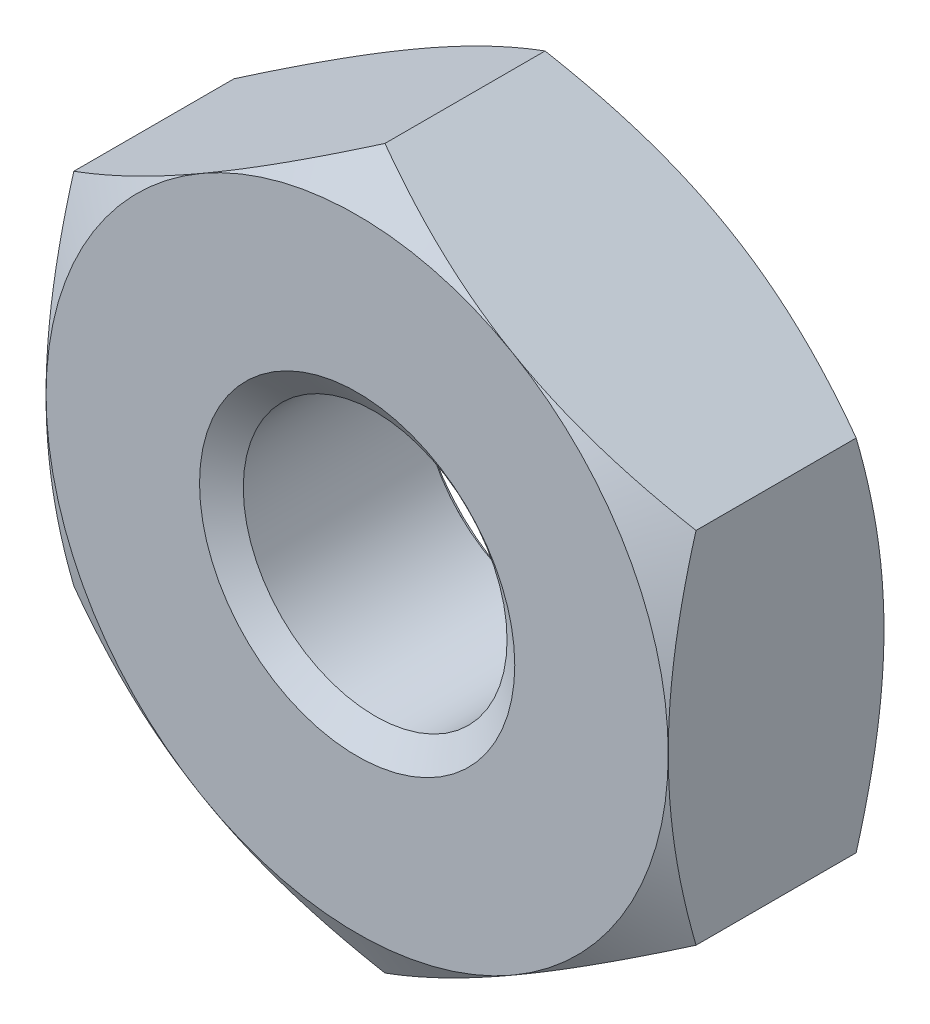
ISO-10303-21;
HEADER;
FILE_DESCRIPTION(('STEP AP214'),'2;1');
FILE_NAME('part.step','',(''),(''),'','','');
FILE_SCHEMA(('AUTOMOTIVE_DESIGN { 1 0 10303 214 1 1 1 1 }'));
ENDSEC;
DATA;
#1=APPLICATION_CONTEXT('core data for automotive mechanical design processes');
#2=APPLICATION_PROTOCOL_DEFINITION('international standard','automotive_design',2000,#1);
#3=PRODUCT_CONTEXT('',#1,'mechanical');
#4=PRODUCT('Part','Part','',(#3));
#5=PRODUCT_RELATED_PRODUCT_CATEGORY('part','',(#4));
#6=PRODUCT_DEFINITION_FORMATION('','',#4);
#7=PRODUCT_DEFINITION_CONTEXT('part definition',#1,'design');
#8=PRODUCT_DEFINITION('design','',#6,#7);
#9=PRODUCT_DEFINITION_SHAPE('','',#8);
#10=(LENGTH_UNIT() NAMED_UNIT(*) SI_UNIT(.MILLI.,.METRE.));
#11=(NAMED_UNIT(*) PLANE_ANGLE_UNIT() SI_UNIT($,.RADIAN.));
#12=(NAMED_UNIT(*) SI_UNIT($,.STERADIAN.) SOLID_ANGLE_UNIT());
#13=UNCERTAINTY_MEASURE_WITH_UNIT(LENGTH_MEASURE(1.E-05),#10,'distance_accuracy_value','');
#14=(GEOMETRIC_REPRESENTATION_CONTEXT(3) GLOBAL_UNCERTAINTY_ASSIGNED_CONTEXT((#13)) GLOBAL_UNIT_ASSIGNED_CONTEXT((#10,
#11,#12)) REPRESENTATION_CONTEXT('',''));
#15=CARTESIAN_POINT('',(0.,0.,0.));
#16=DIRECTION('',(0.,0.,1.));
#17=DIRECTION('',(1.,0.,0.));
#18=AXIS2_PLACEMENT_3D('',#15,#16,#17);
#19=CARTESIAN_POINT('',(0.,0.,-3.302));
#20=DIRECTION('',(0.,0.,1.));
#21=DIRECTION('',(1.,0.,0.));
#22=AXIS2_PLACEMENT_3D('',#19,#20,#21);
#23=CYLINDRICAL_SURFACE('',#22,2.0193);
#24=CARTESIAN_POINT('',(0.,0.,-0.275671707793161));
#25=DIRECTION('',(0.,0.,1.));
#26=DIRECTION('',(1.,0.,0.));
#27=AXIS2_PLACEMENT_3D('',#24,#25,#26);
#28=CIRCLE('',#27,2.0193);
#29=CARTESIAN_POINT('',(2.0193,0.,-0.275671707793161));
#30=VERTEX_POINT('',#29);
#31=EDGE_CURVE('E172',#30,#30,#28,.F.);
#32=CARTESIAN_POINT('',(0.,0.,-3.00092829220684));
#33=DIRECTION('',(0.,0.,-1.));
#34=DIRECTION('',(-1.,0.,0.));
#35=AXIS2_PLACEMENT_3D('',#32,#33,#34);
#36=CIRCLE('',#35,2.0193);
#37=CARTESIAN_POINT('',(2.0193,0.,-3.00092829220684));
#38=VERTEX_POINT('',#37);
#39=EDGE_CURVE('E37',#38,#38,#36,.F.);
#40=CARTESIAN_POINT('',(2.0193,0.,-0.275671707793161));
#41=CARTESIAN_POINT('',(2.0193,0.,-0.304059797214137));
#42=CARTESIAN_POINT('',(2.0193,0.,-0.332447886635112));
#43=CARTESIAN_POINT('',(2.0193,0.,-0.389224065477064));
#44=CARTESIAN_POINT('',(2.0193,0.,-0.41761215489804));
#45=CARTESIAN_POINT('',(2.0193,0.,-0.474388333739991));
#46=CARTESIAN_POINT('',(2.0193,0.,-0.502776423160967));
#47=CARTESIAN_POINT('',(2.0193,0.,-0.559552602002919));
#48=CARTESIAN_POINT('',(2.0193,0.,-0.587940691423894));
#49=CARTESIAN_POINT('',(2.0193,0.,-0.644716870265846));
#50=CARTESIAN_POINT('',(2.0193,0.,-0.673104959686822));
#51=CARTESIAN_POINT('',(2.0193,0.,-0.729881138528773));
#52=CARTESIAN_POINT('',(2.0193,0.,-0.758269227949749));
#53=CARTESIAN_POINT('',(2.0193,0.,-0.815045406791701));
#54=CARTESIAN_POINT('',(2.0193,0.,-0.843433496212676));
#55=CARTESIAN_POINT('',(2.0193,0.,-0.900209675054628));
#56=CARTESIAN_POINT('',(2.0193,0.,-0.928597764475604));
#57=CARTESIAN_POINT('',(2.0193,0.,-0.985373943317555));
#58=CARTESIAN_POINT('',(2.0193,0.,-1.01376203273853));
#59=CARTESIAN_POINT('',(2.0193,0.,-1.07053821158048));
#60=CARTESIAN_POINT('',(2.0193,0.,-1.09892630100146));
#61=CARTESIAN_POINT('',(2.0193,0.,-1.15570247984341));
#62=CARTESIAN_POINT('',(2.0193,0.,-1.18409056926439));
#63=CARTESIAN_POINT('',(2.0193,0.,-1.24086674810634));
#64=CARTESIAN_POINT('',(2.0193,0.,-1.26925483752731));
#65=CARTESIAN_POINT('',(2.0193,0.,-1.32603101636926));
#66=CARTESIAN_POINT('',(2.0193,0.,-1.35441910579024));
#67=CARTESIAN_POINT('',(2.0193,0.,-1.41119528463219));
#68=CARTESIAN_POINT('',(2.0193,0.,-1.43958337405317));
#69=CARTESIAN_POINT('',(2.0193,0.,-1.49635955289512));
#70=CARTESIAN_POINT('',(2.0193,0.,-1.5247476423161));
#71=CARTESIAN_POINT('',(2.0193,0.,-1.58152382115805));
#72=CARTESIAN_POINT('',(2.0193,0.,-1.60991191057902));
#73=CARTESIAN_POINT('',(2.0193,0.,-1.66668808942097));
#74=CARTESIAN_POINT('',(2.0193,0.,-1.69507617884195));
#75=CARTESIAN_POINT('',(2.0193,0.,-1.7518523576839));
#76=CARTESIAN_POINT('',(2.0193,0.,-1.78024044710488));
#77=CARTESIAN_POINT('',(2.0193,0.,-1.83701662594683));
#78=CARTESIAN_POINT('',(2.0193,0.,-1.8654047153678));
#79=CARTESIAN_POINT('',(2.0193,0.,-1.92218089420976));
#80=CARTESIAN_POINT('',(2.0193,0.,-1.95056898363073));
#81=CARTESIAN_POINT('',(2.0193,0.,-2.00734516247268));
#82=CARTESIAN_POINT('',(2.0193,0.,-2.03573325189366));
#83=CARTESIAN_POINT('',(2.0193,0.,-2.09250943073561));
#84=CARTESIAN_POINT('',(2.0193,0.,-2.12089752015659));
#85=CARTESIAN_POINT('',(2.0193,0.,-2.17767369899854));
#86=CARTESIAN_POINT('',(2.0193,0.,-2.20606178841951));
#87=CARTESIAN_POINT('',(2.0193,0.,-2.26283796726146));
#88=CARTESIAN_POINT('',(2.0193,0.,-2.29122605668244));
#89=CARTESIAN_POINT('',(2.0193,0.,-2.34800223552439));
#90=CARTESIAN_POINT('',(2.0193,0.,-2.37639032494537));
#91=CARTESIAN_POINT('',(2.0193,0.,-2.43316650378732));
#92=CARTESIAN_POINT('',(2.0193,0.,-2.4615545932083));
#93=CARTESIAN_POINT('',(2.0193,0.,-2.51833077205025));
#94=CARTESIAN_POINT('',(2.0193,0.,-2.54671886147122));
#95=CARTESIAN_POINT('',(2.0193,0.,-2.60349504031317));
#96=CARTESIAN_POINT('',(2.0193,0.,-2.63188312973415));
#97=CARTESIAN_POINT('',(2.0193,0.,-2.6886593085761));
#98=CARTESIAN_POINT('',(2.0193,0.,-2.71704739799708));
#99=CARTESIAN_POINT('',(2.0193,0.,-2.77382357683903));
#100=CARTESIAN_POINT('',(2.0193,0.,-2.80221166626));
#101=CARTESIAN_POINT('',(2.0193,0.,-2.85898784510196));
#102=CARTESIAN_POINT('',(2.0193,0.,-2.88737593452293));
#103=CARTESIAN_POINT('',(2.0193,0.,-2.94415211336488));
#104=CARTESIAN_POINT('',(2.0193,0.,-2.97254020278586));
#105=CARTESIAN_POINT('',(2.0193,0.,-3.00092829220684));
#106=B_SPLINE_CURVE_WITH_KNOTS('',3,(#40,#41,#42,#43,#44,#45,#46,#47,#48,#49,#50,#51,#52,#53,
#54,#55,#56,#57,#58,#59,#60,#61,#62,#63,#64,#65,#66,#67,#68,#69,#70,#71,#72,#73,#74,#75,#76,#77,
#78,#79,#80,#81,#82,#83,#84,#85,#86,#87,#88,#89,#90,#91,#92,#93,#94,#95,#96,#97,#98,#99,#100,
#101,#102,#103,#104,#105),.UNSPECIFIED.,.F.,.F.,(4,2,2,2,2,2,2,2,2,2,2,2,2,2,2,2,2,2,2,2,2,2,2,
2,2,2,2,2,2,2,2,2,4),(0.,0.0851642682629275,0.170328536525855,0.255492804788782,
0.34065707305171,0.425821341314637,0.510985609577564,0.596149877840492,0.681314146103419,
0.766478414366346,0.851642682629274,0.936806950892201,1.02197121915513,1.10713548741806,
1.19229975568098,1.27746402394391,1.36262829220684,1.44779256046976,1.53295682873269,
1.61812109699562,1.70328536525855,1.78844963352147,1.8736139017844,1.95877817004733,
2.04394243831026,2.12910670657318,2.21427097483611,2.29943524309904,2.38459951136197,
2.46976377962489,2.55492804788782,2.64009231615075,2.72525658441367),.UNSPECIFIED.);
#107=EDGE_CURVE('BSEAM32',#30,#38,#106,.T.);
#108=ORIENTED_EDGE('',*,*,#31,.F.);
#109=ORIENTED_EDGE('',*,*,#39,.F.);
#110=ORIENTED_EDGE('',*,*,#107,.T.);
#111=ORIENTED_EDGE('',*,*,#107,.F.);
#112=EDGE_LOOP('',(#108,#110,#109,#111));
#113=FACE_BOUND('',#112,.T.);
#114=ADVANCED_FACE('F32',(#113),#23,.F.);
#115=CARTESIAN_POINT('',(0.,5.49926131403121,-3.302));
#116=DIRECTION('',(0.,0.,-1.));
#117=DIRECTION('',(-1.,0.,0.));
#118=AXIS2_PLACEMENT_3D('',#115,#116,#117);
#119=PLANE('',#118);
#120=CARTESIAN_POINT('',(0.,0.,-3.302));
#121=DIRECTION('',(0.,0.,-1.));
#122=DIRECTION('',(-1.,0.,0.));
#123=AXIS2_PLACEMENT_3D('',#120,#121,#122);
#124=CIRCLE('',#123,4.7625);
#125=CARTESIAN_POINT('',(-4.7625,0.,-3.302));
#126=VERTEX_POINT('',#125);
#127=CARTESIAN_POINT('',(-2.38125,-4.12444598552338,-3.302));
#128=VERTEX_POINT('',#127);
#129=EDGE_CURVE('E168',#126,#128,#124,.F.);
#130=ORIENTED_EDGE('',*,*,#129,.F.);
#131=CARTESIAN_POINT('',(-2.38125000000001,4.1244459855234,-3.302));
#132=VERTEX_POINT('',#131);
#133=EDGE_CURVE('E150',#132,#126,#124,.F.);
#134=ORIENTED_EDGE('',*,*,#133,.F.);
#135=CARTESIAN_POINT('',(2.38125,4.12444598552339,-3.302));
#136=VERTEX_POINT('',#135);
#137=EDGE_CURVE('E167',#136,#132,#124,.F.);
#138=ORIENTED_EDGE('',*,*,#137,.F.);
#139=CARTESIAN_POINT('',(0.,0.,-3.302));
#140=DIRECTION('',(0.,0.,1.));
#141=DIRECTION('',(1.,0.,0.));
#142=AXIS2_PLACEMENT_3D('',#139,#140,#141);
#143=CIRCLE('',#142,4.7625);
#144=CARTESIAN_POINT('',(4.7625,0.,-3.302));
#145=VERTEX_POINT('',#144);
#146=EDGE_CURVE('E242',#145,#136,#143,.T.);
#147=ORIENTED_EDGE('',*,*,#146,.F.);
#148=CARTESIAN_POINT('',(2.38125000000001,-4.12444598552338,-3.302));
#149=VERTEX_POINT('',#148);
#150=EDGE_CURVE('E374',#149,#145,#124,.F.);
#151=ORIENTED_EDGE('',*,*,#150,.F.);
#152=EDGE_CURVE('E395',#128,#149,#124,.F.);
#153=ORIENTED_EDGE('',*,*,#152,.F.);
#154=EDGE_LOOP('',(#130,#134,#138,#147,#151,#153));
#155=FACE_BOUND('',#154,.T.);
#156=CARTESIAN_POINT('',(0.,0.,-3.302));
#157=DIRECTION('',(0.,0.,-1.));
#158=DIRECTION('',(-1.,0.,0.));
#159=AXIS2_PLACEMENT_3D('',#156,#157,#158);
#160=CIRCLE('',#159,2.413);
#161=CARTESIAN_POINT('',(2.413,0.,-3.302));
#162=VERTEX_POINT('',#161);
#163=EDGE_CURVE('E175',#162,#162,#160,.F.);
#164=ORIENTED_EDGE('',*,*,#163,.T.);
#165=EDGE_LOOP('',(#164));
#166=FACE_BOUND('',#165,.T.);
#167=ADVANCED_FACE('F247',(#155,#166),#119,.T.);
#168=CARTESIAN_POINT('',(0.,5.49926131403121,0.));
#169=DIRECTION('',(0.,0.,-1.));
#170=DIRECTION('',(-1.,0.,0.));
#171=AXIS2_PLACEMENT_3D('',#168,#169,#170);
#172=PLANE('',#171);
#173=CARTESIAN_POINT('',(0.,0.,0.));
#174=DIRECTION('',(0.,0.,-1.));
#175=DIRECTION('',(-1.,0.,0.));
#176=AXIS2_PLACEMENT_3D('',#173,#174,#175);
#177=CIRCLE('',#176,4.7625);
#178=CARTESIAN_POINT('',(-4.7625,0.,0.));
#179=VERTEX_POINT('',#178);
#180=CARTESIAN_POINT('',(-2.38125000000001,4.1244459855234,0.));
#181=VERTEX_POINT('',#180);
#182=EDGE_CURVE('E11',#179,#181,#177,.T.);
#183=ORIENTED_EDGE('',*,*,#182,.F.);
#184=CARTESIAN_POINT('',(-2.38125,-4.12444598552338,0.));
#185=VERTEX_POINT('',#184);
#186=EDGE_CURVE('E44',#185,#179,#177,.T.);
#187=ORIENTED_EDGE('',*,*,#186,.F.);
#188=CARTESIAN_POINT('',(2.38125000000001,-4.12444598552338,0.));
#189=VERTEX_POINT('',#188);
#190=EDGE_CURVE('E171',#189,#185,#177,.T.);
#191=ORIENTED_EDGE('',*,*,#190,.F.);
#192=CARTESIAN_POINT('',(4.7625,0.,0.));
#193=VERTEX_POINT('',#192);
#194=EDGE_CURVE('E340',#193,#189,#177,.T.);
#195=ORIENTED_EDGE('',*,*,#194,.F.);
#196=CARTESIAN_POINT('',(0.,0.,0.));
#197=DIRECTION('',(0.,0.,1.));
#198=DIRECTION('',(1.,0.,0.));
#199=AXIS2_PLACEMENT_3D('',#196,#197,#198);
#200=CIRCLE('',#199,4.7625);
#201=CARTESIAN_POINT('',(2.38125,4.12444598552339,0.));
#202=VERTEX_POINT('',#201);
#203=EDGE_CURVE('E126',#193,#202,#200,.T.);
#204=ORIENTED_EDGE('',*,*,#203,.T.);
#205=EDGE_CURVE('E42',#181,#202,#177,.T.);
#206=ORIENTED_EDGE('',*,*,#205,.F.);
#207=EDGE_LOOP('',(#183,#187,#191,#195,#204,#206));
#208=FACE_BOUND('',#207,.T.);
#209=CARTESIAN_POINT('',(0.,0.,0.));
#210=DIRECTION('',(0.,0.,1.));
#211=DIRECTION('',(1.,0.,0.));
#212=AXIS2_PLACEMENT_3D('',#209,#210,#211);
#213=CIRCLE('',#212,2.413);
#214=CARTESIAN_POINT('',(2.413,0.,0.));
#215=VERTEX_POINT('',#214);
#216=EDGE_CURVE('E174',#215,#215,#213,.T.);
#217=ORIENTED_EDGE('',*,*,#216,.F.);
#218=EDGE_LOOP('',(#217));
#219=FACE_BOUND('',#218,.T.);
#220=ADVANCED_FACE('F299',(#208,#219),#172,.F.);
#221=CARTESIAN_POINT('',(0.,5.49926131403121,-3.302));
#222=DIRECTION('',(-0.500000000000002,0.866025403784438,0.));
#223=DIRECTION('',(-0.866025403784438,-0.500000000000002,0.));
#224=AXIS2_PLACEMENT_3D('',#221,#222,#223);
#225=PLANE('',#224);
#226=DIRECTION('',(0.,0.,1.));
#227=VECTOR('',#226,1.);
#228=CARTESIAN_POINT('',(-4.7625,2.7496306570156,-3.302));
#229=LINE('',#228,#227);
#230=CARTESIAN_POINT('',(-4.7625,2.74963065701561,-2.87663065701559));
#231=VERTEX_POINT('',#230);
#232=CARTESIAN_POINT('',(-4.7625,2.7496306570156,-0.425369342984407));
#233=VERTEX_POINT('',#232);
#234=EDGE_CURVE('E162',#231,#233,#229,.T.);
#235=ORIENTED_EDGE('',*,*,#234,.T.);
#236=CARTESIAN_POINT('',(-4.7627,2.74951518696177,-0.425436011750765));
#237=CARTESIAN_POINT('',(-4.55340263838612,2.87035307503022,-0.355653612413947));
#238=CARTESIAN_POINT('',(-4.34231515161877,2.99222449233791,-0.292183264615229));
#239=CARTESIAN_POINT('',(-3.91648500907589,3.23807763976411,-0.181395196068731));
#240=CARTESIAN_POINT('',(-3.701734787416,3.36206373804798,-0.134116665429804));
#241=CARTESIAN_POINT('',(-3.27486304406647,3.60851825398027,-0.060533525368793));
#242=CARTESIAN_POINT('',(-3.06280800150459,3.73094828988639,-0.0337387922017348));
#243=CARTESIAN_POINT('',(-2.74397949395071,3.91502401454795,-0.00971112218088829));
#244=CARTESIAN_POINT('',(-2.63763059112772,3.97642458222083,-0.00439464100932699));
#245=CARTESIAN_POINT('',(-2.42483449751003,4.0992824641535,0.000759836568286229));
#246=CARTESIAN_POINT('',(-2.31838730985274,4.1607397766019,0.000598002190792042));
#247=CARTESIAN_POINT('',(-2.02675051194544,4.32911636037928,-0.00738494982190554));
#248=CARTESIAN_POINT('',(-1.84165753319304,4.4359798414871,-0.0207924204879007));
#249=CARTESIAN_POINT('',(-1.47270002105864,4.64899756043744,-0.0633078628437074));
#250=CARTESIAN_POINT('',(-1.28883678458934,4.75515104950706,-0.0924303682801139));
#251=CARTESIAN_POINT('',(-0.919135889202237,4.96859796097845,-0.165229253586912));
#252=CARTESIAN_POINT('',(-0.733344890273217,5.07586444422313,-0.209214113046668));
#253=CARTESIAN_POINT('',(-0.364533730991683,5.28879766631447,-0.30904227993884));
#254=CARTESIAN_POINT('',(-0.181508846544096,5.39446713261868,-0.364862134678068));
#255=CARTESIAN_POINT('',(0.000199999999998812,5.49937678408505,-0.42543601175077));
#256=B_SPLINE_CURVE_WITH_KNOTS('',3,(#236,#237,#238,#239,#240,#241,#242,#243,#244,#245,#246,
#247,#248,#249,#250,#251,#252,#253,#254,#255),.UNSPECIFIED.,.F.,.F.,(4,2,2,2,2,2,2,2,2,4),(0.,
0.754910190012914,1.51163483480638,2.24963134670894,2.61827336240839,2.98690399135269,
3.62867423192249,4.27103902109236,4.92765153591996,5.58297484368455),.UNSPECIFIED.);
#257=EDGE_CURVE('E131',#233,#181,#256,.T.);
#258=ORIENTED_EDGE('',*,*,#257,.T.);
#259=CARTESIAN_POINT('',(0.,5.4992613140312,-0.42536934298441));
#260=VERTEX_POINT('',#259);
#261=EDGE_CURVE('E51',#181,#260,#256,.T.);
#262=ORIENTED_EDGE('',*,*,#261,.T.);
#263=DIRECTION('',(0.,0.,1.));
#264=VECTOR('',#263,1.);
#265=CARTESIAN_POINT('',(0.,5.49926131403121,-3.302));
#266=LINE('',#265,#264);
#267=CARTESIAN_POINT('',(0.,5.4992613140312,-2.87663065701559));
#268=VERTEX_POINT('',#267);
#269=EDGE_CURVE('E147',#268,#260,#266,.T.);
#270=ORIENTED_EDGE('',*,*,#269,.F.);
#271=CARTESIAN_POINT('',(-4.7627,2.74951518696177,-2.87656398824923));
#272=CARTESIAN_POINT('',(-4.55340263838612,2.87035307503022,-2.94634638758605));
#273=CARTESIAN_POINT('',(-4.34231515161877,2.99222449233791,-3.00981673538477));
#274=CARTESIAN_POINT('',(-3.91648500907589,3.23807763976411,-3.12060480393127));
#275=CARTESIAN_POINT('',(-3.701734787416,3.36206373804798,-3.16788333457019));
#276=CARTESIAN_POINT('',(-3.27486304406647,3.60851825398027,-3.2414664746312));
#277=CARTESIAN_POINT('',(-3.06280800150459,3.73094828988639,-3.26826120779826));
#278=CARTESIAN_POINT('',(-2.74397949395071,3.91502401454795,-3.29228887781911));
#279=CARTESIAN_POINT('',(-2.63763059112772,3.97642458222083,-3.29760535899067));
#280=CARTESIAN_POINT('',(-2.42483449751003,4.0992824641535,-3.30275983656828));
#281=CARTESIAN_POINT('',(-2.31838730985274,4.1607397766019,-3.30259800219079));
#282=CARTESIAN_POINT('',(-2.02675051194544,4.32911636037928,-3.29461505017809));
#283=CARTESIAN_POINT('',(-1.84165753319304,4.4359798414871,-3.2812075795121));
#284=CARTESIAN_POINT('',(-1.47270002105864,4.64899756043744,-3.23869213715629));
#285=CARTESIAN_POINT('',(-1.28883678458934,4.75515104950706,-3.20956963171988));
#286=CARTESIAN_POINT('',(-0.919135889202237,4.96859796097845,-3.13677074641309));
#287=CARTESIAN_POINT('',(-0.733344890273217,5.07586444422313,-3.09278588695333));
#288=CARTESIAN_POINT('',(-0.364533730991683,5.28879766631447,-2.99295772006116));
#289=CARTESIAN_POINT('',(-0.181508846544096,5.39446713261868,-2.93713786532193));
#290=CARTESIAN_POINT('',(0.000199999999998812,5.49937678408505,-2.87656398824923));
#291=B_SPLINE_CURVE_WITH_KNOTS('',3,(#271,#272,#273,#274,#275,#276,#277,#278,#279,#280,#281,
#282,#283,#284,#285,#286,#287,#288,#289,#290),.UNSPECIFIED.,.F.,.F.,(4,2,2,2,2,2,2,2,2,4),(0.,
0.754910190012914,1.51163483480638,2.24963134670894,2.61827336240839,2.98690399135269,
3.62867423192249,4.27103902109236,4.92765153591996,5.58297484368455),.UNSPECIFIED.);
#292=EDGE_CURVE('E165',#132,#268,#291,.T.);
#293=ORIENTED_EDGE('',*,*,#292,.F.);
#294=EDGE_CURVE('E257',#231,#132,#291,.T.);
#295=ORIENTED_EDGE('',*,*,#294,.F.);
#296=EDGE_LOOP('',(#235,#258,#262,#270,#293,#295));
#297=FACE_BOUND('',#296,.T.);
#298=ADVANCED_FACE('F34',(#297),#225,.T.);
#299=CARTESIAN_POINT('',(4.7625,2.7496306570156,-3.302));
#300=DIRECTION('',(0.500000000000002,0.866025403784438,0.));
#301=DIRECTION('',(-0.866025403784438,0.500000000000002,0.));
#302=AXIS2_PLACEMENT_3D('',#299,#300,#301);
#303=PLANE('',#302);
#304=ORIENTED_EDGE('',*,*,#269,.T.);
#305=CARTESIAN_POINT('',(-0.000200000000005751,5.49937678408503,-0.42543601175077));
#306=CARTESIAN_POINT('',(0.209097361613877,5.37853889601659,-0.355653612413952));
#307=CARTESIAN_POINT('',(0.420184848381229,5.2566674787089,-0.292183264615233));
#308=CARTESIAN_POINT('',(0.846014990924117,5.01081433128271,-0.181395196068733));
#309=CARTESIAN_POINT('',(1.06076521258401,4.88682823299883,-0.134116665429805));
#310=CARTESIAN_POINT('',(1.48763695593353,4.64037371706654,-0.0605335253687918));
#311=CARTESIAN_POINT('',(1.69969199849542,4.51794368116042,-0.0337387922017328));
#312=CARTESIAN_POINT('',(2.0185205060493,4.33386795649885,-0.00971112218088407));
#313=CARTESIAN_POINT('',(2.12486940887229,4.27246738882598,-0.00439464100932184));
#314=CARTESIAN_POINT('',(2.33766550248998,4.1496095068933,0.000759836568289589));
#315=CARTESIAN_POINT('',(2.44411269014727,4.08815219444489,0.000598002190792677));
#316=CARTESIAN_POINT('',(2.73574948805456,3.91977561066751,-0.00738494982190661));
#317=CARTESIAN_POINT('',(2.92084246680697,3.8129121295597,-0.0207924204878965));
#318=CARTESIAN_POINT('',(3.28979997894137,3.59989441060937,-0.0633078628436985));
#319=CARTESIAN_POINT('',(3.47366321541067,3.49374092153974,-0.0924303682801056));
#320=CARTESIAN_POINT('',(3.84336411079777,3.28029401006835,-0.165229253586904));
#321=CARTESIAN_POINT('',(4.02915510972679,3.17302752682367,-0.209214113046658));
#322=CARTESIAN_POINT('',(4.39796626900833,2.96009430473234,-0.30904227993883));
#323=CARTESIAN_POINT('',(4.58099115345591,2.85442483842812,-0.364862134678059));
#324=CARTESIAN_POINT('',(4.7627,2.74951518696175,-0.425436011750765));
#325=B_SPLINE_CURVE_WITH_KNOTS('',3,(#305,#306,#307,#308,#309,#310,#311,#312,#313,#314,#315,
#316,#317,#318,#319,#320,#321,#322,#323,#324),.UNSPECIFIED.,.F.,.F.,(4,2,2,2,2,2,2,2,2,4),(0.,
0.754910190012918,1.51163483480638,2.24963134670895,2.6182733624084,2.98690399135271,
3.6286742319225,4.27103902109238,4.92765153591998,5.58297484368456),.UNSPECIFIED.);
#326=EDGE_CURVE('E141',#260,#202,#325,.T.);
#327=ORIENTED_EDGE('',*,*,#326,.T.);
#328=CARTESIAN_POINT('',(4.7625,2.74963065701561,-0.42536934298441));
#329=VERTEX_POINT('',#328);
#330=EDGE_CURVE('E58',#202,#329,#325,.T.);
#331=ORIENTED_EDGE('',*,*,#330,.T.);
#332=DIRECTION('',(0.,0.,1.));
#333=VECTOR('',#332,1.);
#334=CARTESIAN_POINT('',(4.7625,2.7496306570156,-3.302));
#335=LINE('',#334,#333);
#336=CARTESIAN_POINT('',(4.7625,2.74963065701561,-2.87663065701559));
#337=VERTEX_POINT('',#336);
#338=EDGE_CURVE('E140',#337,#329,#335,.T.);
#339=ORIENTED_EDGE('',*,*,#338,.F.);
#340=CARTESIAN_POINT('',(-0.000200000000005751,5.49937678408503,-2.87656398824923));
#341=CARTESIAN_POINT('',(0.209097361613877,5.37853889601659,-2.94634638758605));
#342=CARTESIAN_POINT('',(0.420184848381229,5.2566674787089,-3.00981673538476));
#343=CARTESIAN_POINT('',(0.846014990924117,5.01081433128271,-3.12060480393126));
#344=CARTESIAN_POINT('',(1.06076521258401,4.88682823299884,-3.16788333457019));
#345=CARTESIAN_POINT('',(1.48763695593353,4.64037371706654,-3.24146647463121));
#346=CARTESIAN_POINT('',(1.69969199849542,4.51794368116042,-3.26826120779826));
#347=CARTESIAN_POINT('',(2.0185205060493,4.33386795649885,-3.29228887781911));
#348=CARTESIAN_POINT('',(2.12486940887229,4.27246738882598,-3.29760535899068));
#349=CARTESIAN_POINT('',(2.33766550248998,4.1496095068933,-3.30275983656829));
#350=CARTESIAN_POINT('',(2.44411269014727,4.08815219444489,-3.30259800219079));
#351=CARTESIAN_POINT('',(2.73574948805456,3.91977561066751,-3.29461505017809));
#352=CARTESIAN_POINT('',(2.92084246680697,3.8129121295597,-3.2812075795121));
#353=CARTESIAN_POINT('',(3.28979997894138,3.59989441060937,-3.2386921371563));
#354=CARTESIAN_POINT('',(3.47366321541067,3.49374092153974,-3.20956963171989));
#355=CARTESIAN_POINT('',(3.84336411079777,3.28029401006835,-3.13677074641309));
#356=CARTESIAN_POINT('',(4.0291551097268,3.17302752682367,-3.09278588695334));
#357=CARTESIAN_POINT('',(4.39796626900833,2.96009430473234,-2.99295772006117));
#358=CARTESIAN_POINT('',(4.58099115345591,2.85442483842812,-2.93713786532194));
#359=CARTESIAN_POINT('',(4.7627,2.74951518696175,-2.87656398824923));
#360=B_SPLINE_CURVE_WITH_KNOTS('',3,(#340,#341,#342,#343,#344,#345,#346,#347,#348,#349,#350,
#351,#352,#353,#354,#355,#356,#357,#358,#359),.UNSPECIFIED.,.F.,.F.,(4,2,2,2,2,2,2,2,2,4),(0.,
0.754910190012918,1.51163483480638,2.24963134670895,2.6182733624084,2.98690399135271,
3.62867423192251,4.27103902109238,4.92765153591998,5.58297484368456),.UNSPECIFIED.);
#361=EDGE_CURVE('E251',#136,#337,#360,.T.);
#362=ORIENTED_EDGE('',*,*,#361,.F.);
#363=EDGE_CURVE('E256',#268,#136,#360,.T.);
#364=ORIENTED_EDGE('',*,*,#363,.F.);
#365=EDGE_LOOP('',(#304,#327,#331,#339,#362,#364));
#366=FACE_BOUND('',#365,.T.);
#367=ADVANCED_FACE('F138',(#366),#303,.T.);
#368=CARTESIAN_POINT('',(4.7625,2.7496306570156,-3.302));
#369=DIRECTION('',(-1.,0.,0.));
#370=DIRECTION('',(0.,0.,1.));
#371=AXIS2_PLACEMENT_3D('',#368,#369,#370);
#372=PLANE('',#371);
#373=CARTESIAN_POINT('',(4.7625,-7.29242571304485,-2.27898343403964));
#374=CARTESIAN_POINT('',(4.7625,-7.08332503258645,-2.17793443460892));
#375=CARTESIAN_POINT('',(4.7625,-6.8737299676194,-2.07788994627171));
#376=CARTESIAN_POINT('',(4.7625,-6.45328375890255,-1.88038400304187));
#377=CARTESIAN_POINT('',(4.7625,-6.24243240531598,-1.78292299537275));
#378=CARTESIAN_POINT('',(4.7625,-5.818067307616,-1.59064459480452));
#379=CARTESIAN_POINT('',(4.7625,-5.60454523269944,-1.49584552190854));
#380=CARTESIAN_POINT('',(4.7625,-5.17574610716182,-1.31031922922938));
#381=CARTESIAN_POINT('',(4.7625,-4.96046914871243,-1.21959179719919));
#382=CARTESIAN_POINT('',(4.7625,-4.52514542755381,-1.04221436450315));
#383=CARTESIAN_POINT('',(4.7625,-4.30507255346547,-0.955628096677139));
#384=CARTESIAN_POINT('',(4.7625,-3.86233085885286,-0.789237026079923));
#385=CARTESIAN_POINT('',(4.7625,-3.6396617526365,-0.709432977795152));
#386=CARTESIAN_POINT('',(4.7625,-3.19183146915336,-0.558750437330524));
#387=CARTESIAN_POINT('',(4.7625,-2.96667674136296,-0.487852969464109));
#388=CARTESIAN_POINT('',(4.7625,-2.51316408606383,-0.357286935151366));
#389=CARTESIAN_POINT('',(4.7625,-2.28480719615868,-0.297614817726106));
#390=CARTESIAN_POINT('',(4.7625,-1.82474524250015,-0.192393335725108));
#391=CARTESIAN_POINT('',(4.7625,-1.59303930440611,-0.146847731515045));
#392=CARTESIAN_POINT('',(4.7625,-1.12680140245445,-0.0729572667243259));
#393=CARTESIAN_POINT('',(4.7625,-0.892269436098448,-0.0446124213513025));
#394=CARTESIAN_POINT('',(4.7625,-0.540098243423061,-0.0168127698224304));
#395=CARTESIAN_POINT('',(4.7625,-0.423010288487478,-0.00999774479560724));
#396=CARTESIAN_POINT('',(4.7625,-0.188645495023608,-0.00132916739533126));
#397=CARTESIAN_POINT('',(4.7625,-0.0713686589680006,0.000524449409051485));
#398=CARTESIAN_POINT('',(4.7625,0.163123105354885,-0.000779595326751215));
#399=CARTESIAN_POINT('',(4.7625,0.280338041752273,-0.00393584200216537));
#400=CARTESIAN_POINT('',(4.7625,0.514533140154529,-0.0151795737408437));
#401=CARTESIAN_POINT('',(4.7625,0.63151328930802,-0.0232673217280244));
#402=CARTESIAN_POINT('',(4.76249999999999,0.915050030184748,-0.048678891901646));
#403=CARTESIAN_POINT('',(4.7625,1.08138937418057,-0.0684745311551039));
#404=CARTESIAN_POINT('',(4.76250000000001,1.41276151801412,-0.116933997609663));
#405=CARTESIAN_POINT('',(4.7625,1.57779414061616,-0.145599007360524));
#406=CARTESIAN_POINT('',(4.7625,2.07083902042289,-0.243383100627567));
#407=CARTESIAN_POINT('',(4.7625,2.39654516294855,-0.324265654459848));
#408=CARTESIAN_POINT('',(4.7625,2.88391142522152,-0.463767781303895));
#409=CARTESIAN_POINT('',(4.7625,3.04811363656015,-0.51400937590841));
#410=CARTESIAN_POINT('',(4.7625,3.37480455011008,-0.619463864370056));
#411=CARTESIAN_POINT('',(4.7625,3.53729434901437,-0.674673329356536));
#412=CARTESIAN_POINT('',(4.7625,3.85988055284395,-0.788914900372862));
#413=CARTESIAN_POINT('',(4.7625,4.0199852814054,-0.847923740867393));
#414=CARTESIAN_POINT('',(4.7625,4.33895253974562,-0.969404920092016));
#415=CARTESIAN_POINT('',(4.7625,4.49781453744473,-1.03187865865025));
#416=CARTESIAN_POINT('',(4.7625,4.65610216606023,-1.09574291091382));
#417=B_SPLINE_CURVE_WITH_KNOTS('',3,(#373,#374,#375,#376,#377,#378,#379,#380,#381,#382,#383,
#384,#385,#386,#387,#388,#389,#390,#391,#392,#393,#394,#395,#396,#397,#398,#399,#400,#401,#402,
#403,#404,#405,#406,#407,#408,#409,#410,#411,#412,#413,#414,#415,#416),.UNSPECIFIED.,.F.,.F.,(4,
2,2,2,2,2,2,2,2,2,2,2,2,2,2,2,2,2,2,2,2,4),(0.,0.696720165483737,1.39356016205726,
2.09438789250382,2.79517904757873,3.5045737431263,4.21404725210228,4.92198260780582,
5.62969364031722,6.33759289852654,7.04549278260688,7.39726182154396,7.74902629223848,
8.10069143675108,8.45237533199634,8.95462912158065,9.45694990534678,10.4623513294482,
10.9774608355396,11.4922174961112,12.0040767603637,12.5161443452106),.UNSPECIFIED.);
#418=CARTESIAN_POINT('',(4.76250000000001,-2.7496306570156,-0.42536934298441));
#419=VERTEX_POINT('',#418);
#420=EDGE_CURVE('E133',#419,#193,#417,.T.);
#421=ORIENTED_EDGE('',*,*,#420,.F.);
#422=DIRECTION('',(0.,0.,1.));
#423=VECTOR('',#422,1.);
#424=CARTESIAN_POINT('',(4.7625,-2.7496306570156,-3.302));
#425=LINE('',#424,#423);
#426=CARTESIAN_POINT('',(4.76250000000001,-2.7496306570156,-2.87663065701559));
#427=VERTEX_POINT('',#426);
#428=EDGE_CURVE('E148',#427,#419,#425,.T.);
#429=ORIENTED_EDGE('',*,*,#428,.F.);
#430=CARTESIAN_POINT('',(4.7625,-7.29242571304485,-1.02301656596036));
#431=CARTESIAN_POINT('',(4.7625,-7.08332503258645,-1.12406556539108));
#432=CARTESIAN_POINT('',(4.7625,-6.8737299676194,-1.22411005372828));
#433=CARTESIAN_POINT('',(4.7625,-6.45328375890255,-1.42161599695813));
#434=CARTESIAN_POINT('',(4.7625,-6.24243240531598,-1.51907700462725));
#435=CARTESIAN_POINT('',(4.7625,-5.818067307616,-1.71135540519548));
#436=CARTESIAN_POINT('',(4.7625,-5.60454523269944,-1.80615447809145));
#437=CARTESIAN_POINT('',(4.7625,-5.17574610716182,-1.99168077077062));
#438=CARTESIAN_POINT('',(4.7625,-4.96046914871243,-2.08240820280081));
#439=CARTESIAN_POINT('',(4.7625,-4.5251454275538,-2.25978563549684));
#440=CARTESIAN_POINT('',(4.7625,-4.30507255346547,-2.34637190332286));
#441=CARTESIAN_POINT('',(4.7625,-3.86233085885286,-2.51276297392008));
#442=CARTESIAN_POINT('',(4.7625,-3.6396617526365,-2.59256702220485));
#443=CARTESIAN_POINT('',(4.7625,-3.19183146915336,-2.74324956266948));
#444=CARTESIAN_POINT('',(4.7625,-2.96667674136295,-2.81414703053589));
#445=CARTESIAN_POINT('',(4.7625,-2.51316408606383,-2.94471306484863));
#446=CARTESIAN_POINT('',(4.7625,-2.28480719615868,-3.00438518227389));
#447=CARTESIAN_POINT('',(4.7625,-1.82474524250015,-3.10960666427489));
#448=CARTESIAN_POINT('',(4.7625,-1.59303930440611,-3.15515226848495));
#449=CARTESIAN_POINT('',(4.7625,-1.12680140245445,-3.22904273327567));
#450=CARTESIAN_POINT('',(4.7625,-0.892269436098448,-3.25738757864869));
#451=CARTESIAN_POINT('',(4.7625,-0.54009824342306,-3.28518723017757));
#452=CARTESIAN_POINT('',(4.7625,-0.423010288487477,-3.29200225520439));
#453=CARTESIAN_POINT('',(4.7625,-0.188645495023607,-3.30067083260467));
#454=CARTESIAN_POINT('',(4.7625,-0.0713686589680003,-3.30252444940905));
#455=CARTESIAN_POINT('',(4.7625,0.163123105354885,-3.30122040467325));
#456=CARTESIAN_POINT('',(4.7625,0.280338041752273,-3.29806415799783));
#457=CARTESIAN_POINT('',(4.7625,0.51453314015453,-3.28682042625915));
#458=CARTESIAN_POINT('',(4.7625,0.631513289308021,-3.27873267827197));
#459=CARTESIAN_POINT('',(4.76249999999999,0.915050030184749,-3.25332110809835));
#460=CARTESIAN_POINT('',(4.7625,1.08138937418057,-3.23352546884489));
#461=CARTESIAN_POINT('',(4.76250000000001,1.41276151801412,-3.18506600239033));
#462=CARTESIAN_POINT('',(4.7625,1.57779414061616,-3.15640099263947));
#463=CARTESIAN_POINT('',(4.7625,2.07083902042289,-3.05861689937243));
#464=CARTESIAN_POINT('',(4.7625,2.39654516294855,-2.97773434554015));
#465=CARTESIAN_POINT('',(4.7625,2.88391142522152,-2.8382322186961));
#466=CARTESIAN_POINT('',(4.7625,3.04811363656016,-2.78799062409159));
#467=CARTESIAN_POINT('',(4.7625,3.37480455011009,-2.68253613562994));
#468=CARTESIAN_POINT('',(4.7625,3.53729434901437,-2.62732667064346));
#469=CARTESIAN_POINT('',(4.7625,3.85988055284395,-2.51308509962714));
#470=CARTESIAN_POINT('',(4.7625,4.0199852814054,-2.4540762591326));
#471=CARTESIAN_POINT('',(4.7625,4.33895253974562,-2.33259507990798));
#472=CARTESIAN_POINT('',(4.7625,4.49781453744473,-2.27012134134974));
#473=CARTESIAN_POINT('',(4.7625,4.65610216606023,-2.20625708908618));
#474=B_SPLINE_CURVE_WITH_KNOTS('',3,(#430,#431,#432,#433,#434,#435,#436,#437,#438,#439,#440,
#441,#442,#443,#444,#445,#446,#447,#448,#449,#450,#451,#452,#453,#454,#455,#456,#457,#458,#459,
#460,#461,#462,#463,#464,#465,#466,#467,#468,#469,#470,#471,#472,#473),.UNSPECIFIED.,.F.,.F.,(4,
2,2,2,2,2,2,2,2,2,2,2,2,2,2,2,2,2,2,2,2,4),(0.,0.696720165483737,1.39356016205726,
2.09438789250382,2.79517904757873,3.5045737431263,4.21404725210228,4.92198260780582,
5.62969364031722,6.33759289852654,7.04549278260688,7.39726182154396,7.74902629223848,
8.10069143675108,8.45237533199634,8.95462912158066,9.45694990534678,10.4623513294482,
10.9774608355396,11.4922174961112,12.0040767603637,12.5161443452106),.UNSPECIFIED.);
#475=EDGE_CURVE('E263',#427,#145,#474,.T.);
#476=ORIENTED_EDGE('',*,*,#475,.T.);
#477=EDGE_CURVE('E146',#145,#337,#474,.T.);
#478=ORIENTED_EDGE('',*,*,#477,.T.);
#479=ORIENTED_EDGE('',*,*,#338,.T.);
#480=EDGE_CURVE('E123',#193,#329,#417,.T.);
#481=ORIENTED_EDGE('',*,*,#480,.F.);
#482=EDGE_LOOP('',(#421,#429,#476,#478,#479,#481));
#483=FACE_BOUND('',#482,.T.);
#484=ADVANCED_FACE('F144',(#483),#372,.F.);
#485=CARTESIAN_POINT('',(0.,-5.4992613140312,-3.302));
#486=DIRECTION('',(0.500000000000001,-0.866025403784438,0.));
#487=DIRECTION('',(0.866025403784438,0.500000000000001,0.));
#488=AXIS2_PLACEMENT_3D('',#485,#486,#487);
#489=PLANE('',#488);
#490=ORIENTED_EDGE('',*,*,#428,.T.);
#491=CARTESIAN_POINT('',(4.76269999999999,-2.74951518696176,-0.42543601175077));
#492=CARTESIAN_POINT('',(4.55340263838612,-2.87035307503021,-0.355653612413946));
#493=CARTESIAN_POINT('',(4.34231515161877,-2.9922244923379,-0.292183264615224));
#494=CARTESIAN_POINT('',(3.91648500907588,-3.2380776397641,-0.181395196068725));
#495=CARTESIAN_POINT('',(3.70173478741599,-3.36206373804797,-0.134116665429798));
#496=CARTESIAN_POINT('',(3.27486304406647,-3.60851825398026,-0.060533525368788));
#497=CARTESIAN_POINT('',(3.06280800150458,-3.73094828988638,-0.0337387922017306));
#498=CARTESIAN_POINT('',(2.7439794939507,-3.91502401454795,-0.00971112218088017));
#499=CARTESIAN_POINT('',(2.63763059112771,-3.97642458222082,-0.00439464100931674));
#500=CARTESIAN_POINT('',(2.42483449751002,-4.09928246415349,0.000759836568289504));
#501=CARTESIAN_POINT('',(2.31838730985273,-4.1607397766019,0.000598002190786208));
#502=CARTESIAN_POINT('',(2.02675051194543,-4.32911636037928,-0.00738494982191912));
#503=CARTESIAN_POINT('',(1.84165753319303,-4.4359798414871,-0.0207924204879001));
#504=CARTESIAN_POINT('',(1.47270002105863,-4.64899756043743,-0.0633078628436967));
#505=CARTESIAN_POINT('',(1.28883678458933,-4.75515104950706,-0.0924303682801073));
#506=CARTESIAN_POINT('',(0.919135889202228,-4.96859796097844,-0.165229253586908));
#507=CARTESIAN_POINT('',(0.733344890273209,-5.07586444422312,-0.209214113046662));
#508=CARTESIAN_POINT('',(0.364533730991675,-5.28879766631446,-0.309042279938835));
#509=CARTESIAN_POINT('',(0.181508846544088,-5.39446713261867,-0.364862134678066));
#510=CARTESIAN_POINT('',(-0.000200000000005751,-5.49937678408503,-0.425436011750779));
#511=B_SPLINE_CURVE_WITH_KNOTS('',3,(#491,#492,#493,#494,#495,#496,#497,#498,#499,#500,#501,
#502,#503,#504,#505,#506,#507,#508,#509,#510),.UNSPECIFIED.,.F.,.F.,(4,2,2,2,2,2,2,2,2,4),(0.,
0.754910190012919,1.51163483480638,2.24963134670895,2.61827336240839,2.9869039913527,
3.6286742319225,4.27103902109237,4.92765153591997,5.58297484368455),.UNSPECIFIED.);
#512=EDGE_CURVE('E343',#419,#189,#511,.T.);
#513=ORIENTED_EDGE('',*,*,#512,.T.);
#514=CARTESIAN_POINT('',(0.,-5.49926131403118,-0.42536934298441));
#515=VERTEX_POINT('',#514);
#516=EDGE_CURVE('E223',#189,#515,#511,.T.);
#517=ORIENTED_EDGE('',*,*,#516,.T.);
#518=DIRECTION('',(0.,0.,1.));
#519=VECTOR('',#518,1.);
#520=CARTESIAN_POINT('',(0.,-5.4992613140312,-3.302));
#521=LINE('',#520,#519);
#522=CARTESIAN_POINT('',(0.,-5.49926131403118,-2.87663065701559));
#523=VERTEX_POINT('',#522);
#524=EDGE_CURVE('E153',#523,#515,#521,.T.);
#525=ORIENTED_EDGE('',*,*,#524,.F.);
#526=CARTESIAN_POINT('',(4.76269999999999,-2.74951518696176,-2.87656398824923));
#527=CARTESIAN_POINT('',(4.55340263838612,-2.87035307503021,-2.94634638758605));
#528=CARTESIAN_POINT('',(4.34231515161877,-2.9922244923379,-3.00981673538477));
#529=CARTESIAN_POINT('',(3.91648500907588,-3.2380776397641,-3.12060480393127));
#530=CARTESIAN_POINT('',(3.70173478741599,-3.36206373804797,-3.1678833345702));
#531=CARTESIAN_POINT('',(3.27486304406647,-3.60851825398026,-3.24146647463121));
#532=CARTESIAN_POINT('',(3.06280800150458,-3.73094828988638,-3.26826120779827));
#533=CARTESIAN_POINT('',(2.7439794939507,-3.91502401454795,-3.29228887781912));
#534=CARTESIAN_POINT('',(2.63763059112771,-3.97642458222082,-3.29760535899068));
#535=CARTESIAN_POINT('',(2.42483449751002,-4.09928246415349,-3.30275983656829));
#536=CARTESIAN_POINT('',(2.31838730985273,-4.1607397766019,-3.30259800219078));
#537=CARTESIAN_POINT('',(2.02675051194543,-4.32911636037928,-3.29461505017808));
#538=CARTESIAN_POINT('',(1.84165753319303,-4.4359798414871,-3.2812075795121));
#539=CARTESIAN_POINT('',(1.47270002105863,-4.64899756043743,-3.2386921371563));
#540=CARTESIAN_POINT('',(1.28883678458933,-4.75515104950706,-3.20956963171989));
#541=CARTESIAN_POINT('',(0.919135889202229,-4.96859796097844,-3.13677074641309));
#542=CARTESIAN_POINT('',(0.73334489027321,-5.07586444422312,-3.09278588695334));
#543=CARTESIAN_POINT('',(0.364533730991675,-5.28879766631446,-2.99295772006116));
#544=CARTESIAN_POINT('',(0.181508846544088,-5.39446713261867,-2.93713786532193));
#545=CARTESIAN_POINT('',(-0.000200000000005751,-5.49937678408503,-2.87656398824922));
#546=B_SPLINE_CURVE_WITH_KNOTS('',3,(#526,#527,#528,#529,#530,#531,#532,#533,#534,#535,#536,
#537,#538,#539,#540,#541,#542,#543,#544,#545),.UNSPECIFIED.,.F.,.F.,(4,2,2,2,2,2,2,2,2,4),(0.,
0.754910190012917,1.51163483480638,2.24963134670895,2.61827336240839,2.9869039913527,
3.6286742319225,4.27103902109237,4.92765153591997,5.58297484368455),.UNSPECIFIED.);
#547=EDGE_CURVE('E269',#149,#523,#546,.T.);
#548=ORIENTED_EDGE('',*,*,#547,.F.);
#549=EDGE_CURVE('E268',#427,#149,#546,.T.);
#550=ORIENTED_EDGE('',*,*,#549,.F.);
#551=EDGE_LOOP('',(#490,#513,#517,#525,#548,#550));
#552=FACE_BOUND('',#551,.T.);
#553=ADVANCED_FACE('F279',(#552),#489,.T.);
#554=CARTESIAN_POINT('',(-4.7625,-2.74963065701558,-3.302));
#555=DIRECTION('',(-0.500000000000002,-0.866025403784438,0.));
#556=DIRECTION('',(0.866025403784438,-0.500000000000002,0.));
#557=AXIS2_PLACEMENT_3D('',#554,#555,#556);
#558=PLANE('',#557);
#559=ORIENTED_EDGE('',*,*,#524,.T.);
#560=CARTESIAN_POINT('',(0.000200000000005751,-5.49937678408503,-0.425436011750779));
#561=CARTESIAN_POINT('',(-0.209097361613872,-5.37853889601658,-0.355653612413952));
#562=CARTESIAN_POINT('',(-0.420184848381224,-5.25666747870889,-0.292183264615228));
#563=CARTESIAN_POINT('',(-0.846014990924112,-5.01081433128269,-0.181395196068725));
#564=CARTESIAN_POINT('',(-1.060765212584,-4.88682823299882,-0.134116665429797));
#565=CARTESIAN_POINT('',(-1.48763695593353,-4.64037371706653,-0.0605335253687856));
#566=CARTESIAN_POINT('',(-1.69969199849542,-4.5179436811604,-0.0337387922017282));
#567=CARTESIAN_POINT('',(-2.0185205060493,-4.33386795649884,-0.00971112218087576));
#568=CARTESIAN_POINT('',(-2.12486940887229,-4.27246738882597,-0.00439464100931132));
#569=CARTESIAN_POINT('',(-2.33766550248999,-4.14960950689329,0.000759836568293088));
#570=CARTESIAN_POINT('',(-2.44411269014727,-4.08815219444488,0.000598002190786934));
#571=CARTESIAN_POINT('',(-2.73574948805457,-3.9197756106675,-0.00738494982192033));
#572=CARTESIAN_POINT('',(-2.92084246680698,-3.81291212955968,-0.0207924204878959));
#573=CARTESIAN_POINT('',(-3.28979997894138,-3.59989441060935,-0.0633078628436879));
#574=CARTESIAN_POINT('',(-3.47366321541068,-3.49374092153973,-0.0924303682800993));
#575=CARTESIAN_POINT('',(-3.84336411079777,-3.28029401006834,-0.1652292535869));
#576=CARTESIAN_POINT('',(-4.02915510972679,-3.17302752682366,-0.209214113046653));
#577=CARTESIAN_POINT('',(-4.39796626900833,-2.96009430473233,-0.309042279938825));
#578=CARTESIAN_POINT('',(-4.58099115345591,-2.85442483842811,-0.364862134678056));
#579=CARTESIAN_POINT('',(-4.7627,-2.74951518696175,-0.42543601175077));
#580=B_SPLINE_CURVE_WITH_KNOTS('',3,(#560,#561,#562,#563,#564,#565,#566,#567,#568,#569,#570,
#571,#572,#573,#574,#575,#576,#577,#578,#579),.UNSPECIFIED.,.F.,.F.,(4,2,2,2,2,2,2,2,2,4),(0.,
0.754910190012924,1.51163483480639,2.24963134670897,2.61827336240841,2.98690399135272,
3.62867423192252,4.27103902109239,4.92765153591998,5.58297484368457),.UNSPECIFIED.);
#581=EDGE_CURVE('E346',#515,#185,#580,.T.);
#582=ORIENTED_EDGE('',*,*,#581,.T.);
#583=CARTESIAN_POINT('',(-4.7625,-2.74963065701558,-0.42536934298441));
#584=VERTEX_POINT('',#583);
#585=EDGE_CURVE('E197',#185,#584,#580,.T.);
#586=ORIENTED_EDGE('',*,*,#585,.T.);
#587=DIRECTION('',(0.,0.,1.));
#588=VECTOR('',#587,1.);
#589=CARTESIAN_POINT('',(-4.7625,-2.74963065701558,-3.302));
#590=LINE('',#589,#588);
#591=CARTESIAN_POINT('',(-4.7625,-2.74963065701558,-2.87663065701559));
#592=VERTEX_POINT('',#591);
#593=EDGE_CURVE('E159',#592,#584,#590,.T.);
#594=ORIENTED_EDGE('',*,*,#593,.F.);
#595=CARTESIAN_POINT('',(0.000200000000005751,-5.49937678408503,-2.87656398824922));
#596=CARTESIAN_POINT('',(-0.209097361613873,-5.37853889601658,-2.94634638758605));
#597=CARTESIAN_POINT('',(-0.420184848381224,-5.25666747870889,-3.00981673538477));
#598=CARTESIAN_POINT('',(-0.846014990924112,-5.01081433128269,-3.12060480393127));
#599=CARTESIAN_POINT('',(-1.060765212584,-4.88682823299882,-3.1678833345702));
#600=CARTESIAN_POINT('',(-1.48763695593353,-4.64037371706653,-3.24146647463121));
#601=CARTESIAN_POINT('',(-1.69969199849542,-4.5179436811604,-3.26826120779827));
#602=CARTESIAN_POINT('',(-2.0185205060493,-4.33386795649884,-3.29228887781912));
#603=CARTESIAN_POINT('',(-2.12486940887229,-4.27246738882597,-3.29760535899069));
#604=CARTESIAN_POINT('',(-2.33766550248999,-4.14960950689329,-3.30275983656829));
#605=CARTESIAN_POINT('',(-2.44411269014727,-4.08815219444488,-3.30259800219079));
#606=CARTESIAN_POINT('',(-2.73574948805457,-3.9197756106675,-3.29461505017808));
#607=CARTESIAN_POINT('',(-2.92084246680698,-3.81291212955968,-3.2812075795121));
#608=CARTESIAN_POINT('',(-3.28979997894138,-3.59989441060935,-3.23869213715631));
#609=CARTESIAN_POINT('',(-3.47366321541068,-3.49374092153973,-3.2095696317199));
#610=CARTESIAN_POINT('',(-3.84336411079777,-3.28029401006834,-3.1367707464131));
#611=CARTESIAN_POINT('',(-4.02915510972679,-3.17302752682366,-3.09278588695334));
#612=CARTESIAN_POINT('',(-4.39796626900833,-2.96009430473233,-2.99295772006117));
#613=CARTESIAN_POINT('',(-4.58099115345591,-2.85442483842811,-2.93713786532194));
#614=CARTESIAN_POINT('',(-4.7627,-2.74951518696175,-2.87656398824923));
#615=B_SPLINE_CURVE_WITH_KNOTS('',3,(#595,#596,#597,#598,#599,#600,#601,#602,#603,#604,#605,
#606,#607,#608,#609,#610,#611,#612,#613,#614),.UNSPECIFIED.,.F.,.F.,(4,2,2,2,2,2,2,2,2,4),(0.,
0.754910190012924,1.51163483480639,2.24963134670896,2.61827336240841,2.98690399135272,
3.62867423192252,4.27103902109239,4.92765153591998,5.58297484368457),.UNSPECIFIED.);
#616=EDGE_CURVE('E275',#128,#592,#615,.T.);
#617=ORIENTED_EDGE('',*,*,#616,.F.);
#618=EDGE_CURVE('E274',#523,#128,#615,.T.);
#619=ORIENTED_EDGE('',*,*,#618,.F.);
#620=EDGE_LOOP('',(#559,#582,#586,#594,#617,#619));
#621=FACE_BOUND('',#620,.T.);
#622=ADVANCED_FACE('F282',(#621),#558,.T.);
#623=CARTESIAN_POINT('',(-4.7625,2.7496306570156,-3.302));
#624=DIRECTION('',(-1.,0.,0.));
#625=DIRECTION('',(0.,0.,1.));
#626=AXIS2_PLACEMENT_3D('',#623,#624,#625);
#627=PLANE('',#626);
#628=ORIENTED_EDGE('',*,*,#593,.T.);
#629=CARTESIAN_POINT('',(-4.7625,-7.29242571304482,-2.27898343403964));
#630=CARTESIAN_POINT('',(-4.7625,-7.08332503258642,-2.17793443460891));
#631=CARTESIAN_POINT('',(-4.7625,-6.87372996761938,-2.07788994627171));
#632=CARTESIAN_POINT('',(-4.7625,-6.45328375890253,-1.88038400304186));
#633=CARTESIAN_POINT('',(-4.7625,-6.24243240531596,-1.78292299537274));
#634=CARTESIAN_POINT('',(-4.7625,-5.81806730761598,-1.59064459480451));
#635=CARTESIAN_POINT('',(-4.7625,-5.60454523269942,-1.49584552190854));
#636=CARTESIAN_POINT('',(-4.7625,-5.1757461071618,-1.31031922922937));
#637=CARTESIAN_POINT('',(-4.7625,-4.96046914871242,-1.21959179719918));
#638=CARTESIAN_POINT('',(-4.7625,-4.52514542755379,-1.04221436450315));
#639=CARTESIAN_POINT('',(-4.7625,-4.30507255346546,-0.955628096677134));
#640=CARTESIAN_POINT('',(-4.7625,-3.86233085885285,-0.789237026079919));
#641=CARTESIAN_POINT('',(-4.7625,-3.63966175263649,-0.709432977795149));
#642=CARTESIAN_POINT('',(-4.7625,-3.19183146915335,-0.558750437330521));
#643=CARTESIAN_POINT('',(-4.7625,-2.96667674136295,-0.487852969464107));
#644=CARTESIAN_POINT('',(-4.7625,-2.51316408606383,-0.357286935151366));
#645=CARTESIAN_POINT('',(-4.7625,-2.28480719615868,-0.297614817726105));
#646=CARTESIAN_POINT('',(-4.7625,-1.82474524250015,-0.192393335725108));
#647=CARTESIAN_POINT('',(-4.7625,-1.59303930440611,-0.146847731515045));
#648=CARTESIAN_POINT('',(-4.7625,-1.12680140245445,-0.072957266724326));
#649=CARTESIAN_POINT('',(-4.7625,-0.892269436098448,-0.0446124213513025));
#650=CARTESIAN_POINT('',(-4.7625,-0.540098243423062,-0.0168127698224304));
#651=CARTESIAN_POINT('',(-4.7625,-0.423010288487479,-0.00999774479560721));
#652=CARTESIAN_POINT('',(-4.7625,-0.188645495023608,-0.00132916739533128));
#653=CARTESIAN_POINT('',(-4.7625,-0.0713686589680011,0.000524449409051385));
#654=CARTESIAN_POINT('',(-4.7625,0.163123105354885,-0.000779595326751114));
#655=CARTESIAN_POINT('',(-4.7625,0.280338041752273,-0.00393584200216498));
#656=CARTESIAN_POINT('',(-4.7625,0.514533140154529,-0.0151795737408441));
#657=CARTESIAN_POINT('',(-4.7625,0.63151328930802,-0.0232673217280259));
#658=CARTESIAN_POINT('',(-4.76249999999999,0.915050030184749,-0.0486788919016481));
#659=CARTESIAN_POINT('',(-4.7625,1.08138937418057,-0.0684745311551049));
#660=CARTESIAN_POINT('',(-4.76250000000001,1.41276151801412,-0.116933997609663));
#661=CARTESIAN_POINT('',(-4.7625,1.57779414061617,-0.145599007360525));
#662=CARTESIAN_POINT('',(-4.7625,2.07083902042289,-0.243383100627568));
#663=CARTESIAN_POINT('',(-4.7625,2.39654516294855,-0.324265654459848));
#664=CARTESIAN_POINT('',(-4.7625,2.88391142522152,-0.463767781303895));
#665=CARTESIAN_POINT('',(-4.7625,3.04811363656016,-0.514009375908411));
#666=CARTESIAN_POINT('',(-4.7625,3.37480455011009,-0.619463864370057));
#667=CARTESIAN_POINT('',(-4.7625,3.53729434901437,-0.674673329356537));
#668=CARTESIAN_POINT('',(-4.7625,3.85988055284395,-0.788914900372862));
#669=CARTESIAN_POINT('',(-4.7625,4.0199852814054,-0.847923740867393));
#670=CARTESIAN_POINT('',(-4.7625,4.33895253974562,-0.969404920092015));
#671=CARTESIAN_POINT('',(-4.7625,4.49781453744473,-1.03187865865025));
#672=CARTESIAN_POINT('',(-4.7625,4.65610216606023,-1.09574291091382));
#673=B_SPLINE_CURVE_WITH_KNOTS('',3,(#629,#630,#631,#632,#633,#634,#635,#636,#637,#638,#639,
#640,#641,#642,#643,#644,#645,#646,#647,#648,#649,#650,#651,#652,#653,#654,#655,#656,#657,#658,
#659,#660,#661,#662,#663,#664,#665,#666,#667,#668,#669,#670,#671,#672),.UNSPECIFIED.,.F.,.F.,(4,
2,2,2,2,2,2,2,2,2,2,2,2,2,2,2,2,2,2,2,2,4),(0.,0.696720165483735,1.39356016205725,
2.09438789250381,2.79517904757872,3.50457374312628,4.21404725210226,4.9219826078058,
5.62969364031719,6.33759289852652,7.04549278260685,7.39726182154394,7.74902629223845,
8.10069143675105,8.45237533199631,8.95462912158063,9.45694990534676,10.4623513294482,
10.9774608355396,11.4922174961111,12.0040767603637,12.5161443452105),.UNSPECIFIED.);
#674=EDGE_CURVE('E196',#584,#179,#673,.T.);
#675=ORIENTED_EDGE('',*,*,#674,.T.);
#676=EDGE_CURVE('E189',#179,#233,#673,.T.);
#677=ORIENTED_EDGE('',*,*,#676,.T.);
#678=ORIENTED_EDGE('',*,*,#234,.F.);
#679=CARTESIAN_POINT('',(-4.7625,-7.29242571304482,-1.02301656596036));
#680=CARTESIAN_POINT('',(-4.7625,-7.08332503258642,-1.12406556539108));
#681=CARTESIAN_POINT('',(-4.7625,-6.87372996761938,-1.22411005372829));
#682=CARTESIAN_POINT('',(-4.7625,-6.45328375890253,-1.42161599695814));
#683=CARTESIAN_POINT('',(-4.7625,-6.24243240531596,-1.51907700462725));
#684=CARTESIAN_POINT('',(-4.7625,-5.81806730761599,-1.71135540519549));
#685=CARTESIAN_POINT('',(-4.7625,-5.60454523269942,-1.80615447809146));
#686=CARTESIAN_POINT('',(-4.7625,-5.1757461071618,-1.99168077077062));
#687=CARTESIAN_POINT('',(-4.7625,-4.96046914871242,-2.08240820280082));
#688=CARTESIAN_POINT('',(-4.7625,-4.52514542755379,-2.25978563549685));
#689=CARTESIAN_POINT('',(-4.7625,-4.30507255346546,-2.34637190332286));
#690=CARTESIAN_POINT('',(-4.7625,-3.86233085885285,-2.51276297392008));
#691=CARTESIAN_POINT('',(-4.7625,-3.63966175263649,-2.59256702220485));
#692=CARTESIAN_POINT('',(-4.7625,-3.19183146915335,-2.74324956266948));
#693=CARTESIAN_POINT('',(-4.7625,-2.96667674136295,-2.81414703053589));
#694=CARTESIAN_POINT('',(-4.7625,-2.51316408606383,-2.94471306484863));
#695=CARTESIAN_POINT('',(-4.7625,-2.28480719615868,-3.00438518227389));
#696=CARTESIAN_POINT('',(-4.7625,-1.82474524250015,-3.10960666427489));
#697=CARTESIAN_POINT('',(-4.7625,-1.59303930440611,-3.15515226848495));
#698=CARTESIAN_POINT('',(-4.7625,-1.12680140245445,-3.22904273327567));
#699=CARTESIAN_POINT('',(-4.7625,-0.892269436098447,-3.25738757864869));
#700=CARTESIAN_POINT('',(-4.7625,-0.54009824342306,-3.28518723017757));
#701=CARTESIAN_POINT('',(-4.7625,-0.423010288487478,-3.29200225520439));
#702=CARTESIAN_POINT('',(-4.7625,-0.188645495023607,-3.30067083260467));
#703=CARTESIAN_POINT('',(-4.7625,-0.0713686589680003,-3.30252444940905));
#704=CARTESIAN_POINT('',(-4.7625,0.163123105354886,-3.30122040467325));
#705=CARTESIAN_POINT('',(-4.7625,0.280338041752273,-3.29806415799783));
#706=CARTESIAN_POINT('',(-4.7625,0.51453314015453,-3.28682042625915));
#707=CARTESIAN_POINT('',(-4.7625,0.631513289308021,-3.27873267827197));
#708=CARTESIAN_POINT('',(-4.76249999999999,0.915050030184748,-3.25332110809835));
#709=CARTESIAN_POINT('',(-4.7625,1.08138937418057,-3.23352546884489));
#710=CARTESIAN_POINT('',(-4.76250000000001,1.41276151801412,-3.18506600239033));
#711=CARTESIAN_POINT('',(-4.7625,1.57779414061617,-3.15640099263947));
#712=CARTESIAN_POINT('',(-4.7625,2.07083902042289,-3.05861689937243));
#713=CARTESIAN_POINT('',(-4.7625,2.39654516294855,-2.97773434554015));
#714=CARTESIAN_POINT('',(-4.7625,2.88391142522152,-2.8382322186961));
#715=CARTESIAN_POINT('',(-4.7625,3.04811363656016,-2.78799062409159));
#716=CARTESIAN_POINT('',(-4.7625,3.37480455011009,-2.68253613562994));
#717=CARTESIAN_POINT('',(-4.7625,3.53729434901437,-2.62732667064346));
#718=CARTESIAN_POINT('',(-4.7625,3.85988055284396,-2.51308509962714));
#719=CARTESIAN_POINT('',(-4.7625,4.0199852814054,-2.4540762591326));
#720=CARTESIAN_POINT('',(-4.7625,4.33895253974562,-2.33259507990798));
#721=CARTESIAN_POINT('',(-4.7625,4.49781453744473,-2.27012134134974));
#722=CARTESIAN_POINT('',(-4.7625,4.65610216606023,-2.20625708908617));
#723=B_SPLINE_CURVE_WITH_KNOTS('',3,(#679,#680,#681,#682,#683,#684,#685,#686,#687,#688,#689,
#690,#691,#692,#693,#694,#695,#696,#697,#698,#699,#700,#701,#702,#703,#704,#705,#706,#707,#708,
#709,#710,#711,#712,#713,#714,#715,#716,#717,#718,#719,#720,#721,#722),.UNSPECIFIED.,.F.,.F.,(4,
2,2,2,2,2,2,2,2,2,2,2,2,2,2,2,2,2,2,2,2,4),(0.,0.696720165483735,1.39356016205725,
2.09438789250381,2.79517904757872,3.50457374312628,4.21404725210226,4.9219826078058,
5.6296936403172,6.33759289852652,7.04549278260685,7.39726182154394,7.74902629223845,
8.10069143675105,8.45237533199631,8.95462912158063,9.45694990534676,10.4623513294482,
10.9774608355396,11.4922174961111,12.0040767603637,12.5161443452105),.UNSPECIFIED.);
#724=EDGE_CURVE('E358',#126,#231,#723,.T.);
#725=ORIENTED_EDGE('',*,*,#724,.F.);
#726=EDGE_CURVE('E360',#592,#126,#723,.T.);
#727=ORIENTED_EDGE('',*,*,#726,.F.);
#728=EDGE_LOOP('',(#628,#675,#677,#678,#725,#727));
#729=FACE_BOUND('',#728,.T.);
#730=ADVANCED_FACE('F203',(#729),#627,.T.);
#731=CARTESIAN_POINT('',(0.,0.,-3.302));
#732=DIRECTION('',(0.,0.,1.));
#733=DIRECTION('',(1.,0.,0.));
#734=AXIS2_PLACEMENT_3D('',#731,#732,#733);
#735=CONICAL_SURFACE('',#734,4.7625,1.0471975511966);
#736=ORIENTED_EDGE('',*,*,#294,.T.);
#737=ORIENTED_EDGE('',*,*,#133,.T.);
#738=ORIENTED_EDGE('',*,*,#724,.T.);
#739=EDGE_LOOP('',(#736,#737,#738));
#740=FACE_BOUND('',#739,.T.);
#741=ADVANCED_FACE('F292',(#740),#735,.T.);
#742=ORIENTED_EDGE('',*,*,#292,.T.);
#743=ORIENTED_EDGE('',*,*,#363,.T.);
#744=ORIENTED_EDGE('',*,*,#137,.T.);
#745=EDGE_LOOP('',(#742,#743,#744));
#746=FACE_BOUND('',#745,.T.);
#747=ADVANCED_FACE('F376',(#746),#735,.T.);
#748=ORIENTED_EDGE('',*,*,#361,.T.);
#749=ORIENTED_EDGE('',*,*,#477,.F.);
#750=ORIENTED_EDGE('',*,*,#146,.T.);
#751=EDGE_LOOP('',(#748,#749,#750));
#752=FACE_BOUND('',#751,.T.);
#753=ADVANCED_FACE('F369',(#752),#735,.T.);
#754=ORIENTED_EDGE('',*,*,#549,.T.);
#755=ORIENTED_EDGE('',*,*,#150,.T.);
#756=ORIENTED_EDGE('',*,*,#475,.F.);
#757=EDGE_LOOP('',(#754,#755,#756));
#758=FACE_BOUND('',#757,.T.);
#759=ADVANCED_FACE('F382',(#758),#735,.T.);
#760=ORIENTED_EDGE('',*,*,#547,.T.);
#761=ORIENTED_EDGE('',*,*,#618,.T.);
#762=ORIENTED_EDGE('',*,*,#152,.T.);
#763=EDGE_LOOP('',(#760,#761,#762));
#764=FACE_BOUND('',#763,.T.);
#765=ADVANCED_FACE('F383',(#764),#735,.T.);
#766=ORIENTED_EDGE('',*,*,#616,.T.);
#767=ORIENTED_EDGE('',*,*,#726,.T.);
#768=ORIENTED_EDGE('',*,*,#129,.T.);
#769=EDGE_LOOP('',(#766,#767,#768));
#770=FACE_BOUND('',#769,.T.);
#771=ADVANCED_FACE('F211',(#770),#735,.T.);
#772=CARTESIAN_POINT('',(0.,0.,0.));
#773=DIRECTION('',(0.,0.,-1.));
#774=DIRECTION('',(-1.,0.,0.));
#775=AXIS2_PLACEMENT_3D('',#772,#773,#774);
#776=CONICAL_SURFACE('',#775,4.7625,1.0471975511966);
#777=ORIENTED_EDGE('',*,*,#186,.T.);
#778=ORIENTED_EDGE('',*,*,#674,.F.);
#779=ORIENTED_EDGE('',*,*,#585,.F.);
#780=EDGE_LOOP('',(#777,#778,#779));
#781=FACE_BOUND('',#780,.T.);
#782=ADVANCED_FACE('F205',(#781),#776,.T.);
#783=ORIENTED_EDGE('',*,*,#190,.T.);
#784=ORIENTED_EDGE('',*,*,#581,.F.);
#785=ORIENTED_EDGE('',*,*,#516,.F.);
#786=EDGE_LOOP('',(#783,#784,#785));
#787=FACE_BOUND('',#786,.T.);
#788=ADVANCED_FACE('F210',(#787),#776,.T.);
#789=ORIENTED_EDGE('',*,*,#420,.T.);
#790=ORIENTED_EDGE('',*,*,#194,.T.);
#791=ORIENTED_EDGE('',*,*,#512,.F.);
#792=EDGE_LOOP('',(#789,#790,#791));
#793=FACE_BOUND('',#792,.T.);
#794=ADVANCED_FACE('F328',(#793),#776,.T.);
#795=ORIENTED_EDGE('',*,*,#203,.F.);
#796=ORIENTED_EDGE('',*,*,#480,.T.);
#797=ORIENTED_EDGE('',*,*,#330,.F.);
#798=EDGE_LOOP('',(#795,#796,#797));
#799=FACE_BOUND('',#798,.T.);
#800=ADVANCED_FACE('F124',(#799),#776,.T.);
#801=ORIENTED_EDGE('',*,*,#205,.T.);
#802=ORIENTED_EDGE('',*,*,#326,.F.);
#803=ORIENTED_EDGE('',*,*,#261,.F.);
#804=EDGE_LOOP('',(#801,#802,#803));
#805=FACE_BOUND('',#804,.T.);
#806=ADVANCED_FACE('F213',(#805),#776,.T.);
#807=ORIENTED_EDGE('',*,*,#676,.F.);
#808=ORIENTED_EDGE('',*,*,#182,.T.);
#809=ORIENTED_EDGE('',*,*,#257,.F.);
#810=EDGE_LOOP('',(#807,#808,#809));
#811=FACE_BOUND('',#810,.T.);
#812=ADVANCED_FACE('F319',(#811),#776,.T.);
#813=CARTESIAN_POINT('',(0.,0.,-0.303238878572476));
#814=DIRECTION('',(0.,0.,1.));
#815=DIRECTION('',(1.,0.,0.));
#816=AXIS2_PLACEMENT_3D('',#813,#814,#815);
#817=CONICAL_SURFACE('',#816,1.97993,0.959931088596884);
#818=CARTESIAN_POINT('',(2.413,0.,0.));
#819=CARTESIAN_POINT('',(2.40889895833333,0.,-0.00287158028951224));
#820=CARTESIAN_POINT('',(2.40479791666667,0.,-0.0057431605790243));
#821=CARTESIAN_POINT('',(2.39659583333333,0.,-0.0114863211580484));
#822=CARTESIAN_POINT('',(2.39249479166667,0.,-0.0143579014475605));
#823=CARTESIAN_POINT('',(2.38429270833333,0.,-0.0201010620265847));
#824=CARTESIAN_POINT('',(2.38019166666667,0.,-0.0229726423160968));
#825=CARTESIAN_POINT('',(2.37198958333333,0.,-0.028715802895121));
#826=CARTESIAN_POINT('',(2.36788854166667,0.,-0.0315873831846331));
#827=CARTESIAN_POINT('',(2.35968645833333,0.,-0.0373305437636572));
#828=CARTESIAN_POINT('',(2.35558541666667,0.,-0.0402021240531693));
#829=CARTESIAN_POINT('',(2.34738333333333,0.,-0.0459452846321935));
#830=CARTESIAN_POINT('',(2.34328229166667,0.,-0.0488168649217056));
#831=CARTESIAN_POINT('',(2.33508020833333,0.,-0.0545600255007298));
#832=CARTESIAN_POINT('',(2.33097916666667,0.,-0.0574316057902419));
#833=CARTESIAN_POINT('',(2.32277708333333,0.,-0.0631747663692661));
#834=CARTESIAN_POINT('',(2.31867604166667,0.,-0.0660463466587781));
#835=CARTESIAN_POINT('',(2.31047395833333,0.,-0.0717895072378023));
#836=CARTESIAN_POINT('',(2.30637291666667,0.,-0.0746610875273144));
#837=CARTESIAN_POINT('',(2.29817083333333,0.,-0.0804042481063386));
#838=CARTESIAN_POINT('',(2.29406979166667,0.,-0.0832758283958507));
#839=CARTESIAN_POINT('',(2.28586770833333,0.,-0.0890189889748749));
#840=CARTESIAN_POINT('',(2.28176666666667,0.,-0.091890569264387));
#841=CARTESIAN_POINT('',(2.27356458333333,0.,-0.0976337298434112));
#842=CARTESIAN_POINT('',(2.26946354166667,0.,-0.100505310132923));
#843=CARTESIAN_POINT('',(2.26126145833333,0.,-0.106248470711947));
#844=CARTESIAN_POINT('',(2.25716041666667,0.,-0.10912005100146));
#845=CARTESIAN_POINT('',(2.24895833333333,0.,-0.114863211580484));
#846=CARTESIAN_POINT('',(2.24485729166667,0.,-0.117734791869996));
#847=CARTESIAN_POINT('',(2.23665520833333,0.,-0.12347795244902));
#848=CARTESIAN_POINT('',(2.23255416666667,0.,-0.126349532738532));
#849=CARTESIAN_POINT('',(2.22435208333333,0.,-0.132092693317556));
#850=CARTESIAN_POINT('',(2.22025104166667,0.,-0.134964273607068));
#851=CARTESIAN_POINT('',(2.21204895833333,0.,-0.140707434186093));
#852=CARTESIAN_POINT('',(2.20794791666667,0.,-0.143579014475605));
#853=CARTESIAN_POINT('',(2.19974583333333,0.,-0.149322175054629));
#854=CARTESIAN_POINT('',(2.19564479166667,0.,-0.152193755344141));
#855=CARTESIAN_POINT('',(2.18744270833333,0.,-0.157936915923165));
#856=CARTESIAN_POINT('',(2.18334166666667,0.,-0.160808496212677));
#857=CARTESIAN_POINT('',(2.17513958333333,0.,-0.166551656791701));
#858=CARTESIAN_POINT('',(2.17103854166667,0.,-0.169423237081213));
#859=CARTESIAN_POINT('',(2.16283645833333,0.,-0.175166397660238));
#860=CARTESIAN_POINT('',(2.15873541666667,0.,-0.17803797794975));
#861=CARTESIAN_POINT('',(2.15053333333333,0.,-0.183781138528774));
#862=CARTESIAN_POINT('',(2.14643229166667,0.,-0.186652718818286));
#863=CARTESIAN_POINT('',(2.13823020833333,0.,-0.19239587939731));
#864=CARTESIAN_POINT('',(2.13412916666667,0.,-0.195267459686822));
#865=CARTESIAN_POINT('',(2.12592708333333,0.,-0.201010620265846));
#866=CARTESIAN_POINT('',(2.12182604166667,0.,-0.203882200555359));
#867=CARTESIAN_POINT('',(2.11362395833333,0.,-0.209625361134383));
#868=CARTESIAN_POINT('',(2.10952291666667,0.,-0.212496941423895));
#869=CARTESIAN_POINT('',(2.10132083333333,0.,-0.218240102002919));
#870=CARTESIAN_POINT('',(2.09721979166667,0.,-0.221111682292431));
#871=CARTESIAN_POINT('',(2.08901770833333,0.,-0.226854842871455));
#872=CARTESIAN_POINT('',(2.08491666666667,0.,-0.229726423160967));
#873=CARTESIAN_POINT('',(2.07671458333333,0.,-0.235469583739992));
#874=CARTESIAN_POINT('',(2.07261354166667,0.,-0.238341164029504));
#875=CARTESIAN_POINT('',(2.06441145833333,0.,-0.244084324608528));
#876=CARTESIAN_POINT('',(2.06031041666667,0.,-0.24695590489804));
#877=CARTESIAN_POINT('',(2.05210833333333,0.,-0.252699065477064));
#878=CARTESIAN_POINT('',(2.04800729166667,0.,-0.255570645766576));
#879=CARTESIAN_POINT('',(2.03980520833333,0.,-0.2613138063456));
#880=CARTESIAN_POINT('',(2.03570416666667,0.,-0.264185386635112));
#881=CARTESIAN_POINT('',(2.02750208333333,0.,-0.269928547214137));
#882=CARTESIAN_POINT('',(2.02340104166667,0.,-0.272800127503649));
#883=CARTESIAN_POINT('',(2.0193,0.,-0.275671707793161));
#884=B_SPLINE_CURVE_WITH_KNOTS('',3,(#818,#819,#820,#821,#822,#823,#824,#825,#826,#827,#828,
#829,#830,#831,#832,#833,#834,#835,#836,#837,#838,#839,#840,#841,#842,#843,#844,#845,#846,#847,
#848,#849,#850,#851,#852,#853,#854,#855,#856,#857,#858,#859,#860,#861,#862,#863,#864,#865,#866,
#867,#868,#869,#870,#871,#872,#873,#874,#875,#876,#877,#878,#879,#880,#881,#882,#883),
.UNSPECIFIED.,.F.,.F.,(4,2,2,2,2,2,2,2,2,2,2,2,2,2,2,2,2,2,2,2,2,2,2,2,2,2,2,2,2,2,2,2,4),(0.,
0.0150193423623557,0.0300386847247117,0.0450580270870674,0.060077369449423,0.0750967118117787,
0.0901160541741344,0.10513539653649,0.120154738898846,0.135174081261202,0.150193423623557,
0.165212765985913,0.180232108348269,0.195251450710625,0.21027079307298,0.225290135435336,
0.240309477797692,0.255328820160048,0.270348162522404,0.285367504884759,0.300386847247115,
0.31540618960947,0.330425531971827,0.345444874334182,0.360464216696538,0.375483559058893,
0.39050290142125,0.405522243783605,0.420541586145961,0.435560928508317,0.450580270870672,
0.465599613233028,0.480618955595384),.UNSPECIFIED.);
#885=EDGE_CURVE('BSEAM214',#215,#30,#884,.T.);
#886=ORIENTED_EDGE('',*,*,#216,.T.);
#887=ORIENTED_EDGE('',*,*,#31,.T.);
#888=ORIENTED_EDGE('',*,*,#885,.T.);
#889=ORIENTED_EDGE('',*,*,#885,.F.);
#890=EDGE_LOOP('',(#886,#888,#887,#889));
#891=FACE_BOUND('',#890,.T.);
#892=ADVANCED_FACE('F214',(#891),#817,.F.);
#893=CARTESIAN_POINT('',(0.,0.,-3.2766));
#894=DIRECTION('',(0.,0.,-1.));
#895=DIRECTION('',(-1.,0.,0.));
#896=AXIS2_PLACEMENT_3D('',#893,#894,#895);
#897=CONICAL_SURFACE('',#896,2.413,0.959931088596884);
#898=CARTESIAN_POINT('',(0.,0.,-3.2766));
#899=DIRECTION('',(0.,0.,1.));
#900=DIRECTION('',(1.,0.,0.));
#901=AXIS2_PLACEMENT_3D('',#898,#899,#900);
#902=CIRCLE('',#901,2.413);
#903=CARTESIAN_POINT('',(2.413,0.,-3.2766));
#904=VERTEX_POINT('',#903);
#905=EDGE_CURVE('E177',#904,#904,#902,.T.);
#906=ORIENTED_EDGE('',*,*,#905,.F.);
#907=EDGE_LOOP('',(#906));
#908=FACE_BOUND('',#907,.T.);
#909=ORIENTED_EDGE('',*,*,#39,.T.);
#910=EDGE_LOOP('',(#909));
#911=FACE_BOUND('',#910,.T.);
#912=ADVANCED_FACE('F318',(#908,#911),#897,.F.);
#913=CARTESIAN_POINT('',(0.,0.,-25.0375057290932));
#914=DIRECTION('',(0.,0.,1.));
#915=DIRECTION('',(1.,0.,0.));
#916=AXIS2_PLACEMENT_3D('',#913,#914,#915);
#917=CYLINDRICAL_SURFACE('',#916,2.413);
#918=CARTESIAN_POINT('',(2.413,0.,-3.302));
#919=CARTESIAN_POINT('',(2.413,0.,-3.30173541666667));
#920=CARTESIAN_POINT('',(2.413,0.,-3.30147083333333));
#921=CARTESIAN_POINT('',(2.413,0.,-3.30094166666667));
#922=CARTESIAN_POINT('',(2.413,0.,-3.30067708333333));
#923=CARTESIAN_POINT('',(2.413,0.,-3.30014791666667));
#924=CARTESIAN_POINT('',(2.413,0.,-3.29988333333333));
#925=CARTESIAN_POINT('',(2.413,0.,-3.29935416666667));
#926=CARTESIAN_POINT('',(2.413,0.,-3.29908958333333));
#927=CARTESIAN_POINT('',(2.413,0.,-3.29856041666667));
#928=CARTESIAN_POINT('',(2.413,0.,-3.29829583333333));
#929=CARTESIAN_POINT('',(2.413,0.,-3.29776666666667));
#930=CARTESIAN_POINT('',(2.413,0.,-3.29750208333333));
#931=CARTESIAN_POINT('',(2.413,0.,-3.29697291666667));
#932=CARTESIAN_POINT('',(2.413,0.,-3.29670833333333));
#933=CARTESIAN_POINT('',(2.413,0.,-3.29617916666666));
#934=CARTESIAN_POINT('',(2.413,0.,-3.29591458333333));
#935=CARTESIAN_POINT('',(2.413,0.,-3.29538541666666));
#936=CARTESIAN_POINT('',(2.413,0.,-3.29512083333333));
#937=CARTESIAN_POINT('',(2.413,0.,-3.29459166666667));
#938=CARTESIAN_POINT('',(2.413,0.,-3.29432708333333));
#939=CARTESIAN_POINT('',(2.413,0.,-3.29379791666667));
#940=CARTESIAN_POINT('',(2.413,0.,-3.29353333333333));
#941=CARTESIAN_POINT('',(2.413,0.,-3.29300416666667));
#942=CARTESIAN_POINT('',(2.413,0.,-3.29273958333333));
#943=CARTESIAN_POINT('',(2.413,0.,-3.29221041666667));
#944=CARTESIAN_POINT('',(2.413,0.,-3.29194583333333));
#945=CARTESIAN_POINT('',(2.413,0.,-3.29141666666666));
#946=CARTESIAN_POINT('',(2.413,0.,-3.29115208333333));
#947=CARTESIAN_POINT('',(2.413,0.,-3.29062291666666));
#948=CARTESIAN_POINT('',(2.413,0.,-3.29035833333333));
#949=CARTESIAN_POINT('',(2.413,0.,-3.28982916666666));
#950=CARTESIAN_POINT('',(2.413,0.,-3.28956458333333));
#951=CARTESIAN_POINT('',(2.413,0.,-3.28903541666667));
#952=CARTESIAN_POINT('',(2.413,0.,-3.28877083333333));
#953=CARTESIAN_POINT('',(2.413,0.,-3.28824166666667));
#954=CARTESIAN_POINT('',(2.413,0.,-3.28797708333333));
#955=CARTESIAN_POINT('',(2.413,0.,-3.28744791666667));
#956=CARTESIAN_POINT('',(2.413,0.,-3.28718333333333));
#957=CARTESIAN_POINT('',(2.413,0.,-3.28665416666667));
#958=CARTESIAN_POINT('',(2.413,0.,-3.28638958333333));
#959=CARTESIAN_POINT('',(2.413,0.,-3.28586041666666));
#960=CARTESIAN_POINT('',(2.413,0.,-3.28559583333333));
#961=CARTESIAN_POINT('',(2.413,0.,-3.28506666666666));
#962=CARTESIAN_POINT('',(2.413,0.,-3.28480208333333));
#963=CARTESIAN_POINT('',(2.413,0.,-3.28427291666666));
#964=CARTESIAN_POINT('',(2.413,0.,-3.28400833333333));
#965=CARTESIAN_POINT('',(2.413,0.,-3.28347916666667));
#966=CARTESIAN_POINT('',(2.413,0.,-3.28321458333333));
#967=CARTESIAN_POINT('',(2.413,0.,-3.28268541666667));
#968=CARTESIAN_POINT('',(2.413,0.,-3.28242083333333));
#969=CARTESIAN_POINT('',(2.413,0.,-3.28189166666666));
#970=CARTESIAN_POINT('',(2.413,0.,-3.28162708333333));
#971=CARTESIAN_POINT('',(2.413,0.,-3.28109791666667));
#972=CARTESIAN_POINT('',(2.413,0.,-3.28083333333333));
#973=CARTESIAN_POINT('',(2.413,0.,-3.28030416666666));
#974=CARTESIAN_POINT('',(2.413,0.,-3.28003958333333));
#975=CARTESIAN_POINT('',(2.413,0.,-3.27951041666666));
#976=CARTESIAN_POINT('',(2.413,0.,-3.27924583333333));
#977=CARTESIAN_POINT('',(2.413,0.,-3.27871666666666));
#978=CARTESIAN_POINT('',(2.413,0.,-3.27845208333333));
#979=CARTESIAN_POINT('',(2.413,0.,-3.27792291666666));
#980=CARTESIAN_POINT('',(2.413,0.,-3.27765833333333));
#981=CARTESIAN_POINT('',(2.413,0.,-3.27712916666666));
#982=CARTESIAN_POINT('',(2.413,0.,-3.27686458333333));
#983=CARTESIAN_POINT('',(2.413,0.,-3.2766));
#984=B_SPLINE_CURVE_WITH_KNOTS('',3,(#918,#919,#920,#921,#922,#923,#924,#925,#926,#927,#928,
#929,#930,#931,#932,#933,#934,#935,#936,#937,#938,#939,#940,#941,#942,#943,#944,#945,#946,#947,
#948,#949,#950,#951,#952,#953,#954,#955,#956,#957,#958,#959,#960,#961,#962,#963,#964,#965,#966,
#967,#968,#969,#970,#971,#972,#973,#974,#975,#976,#977,#978,#979,#980,#981,#982,#983),
.UNSPECIFIED.,.F.,.F.,(4,2,2,2,2,2,2,2,2,2,2,2,2,2,2,2,2,2,2,2,2,2,2,2,2,2,2,2,2,2,2,2,4),(0.,
0.000793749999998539,0.00158750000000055,0.00238124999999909,0.00317500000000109,
0.00396874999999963,0.00476250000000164,0.00555625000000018,0.00635000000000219,
0.00714375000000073,0.00793749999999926,0.00873125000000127,0.00952499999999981,
0.0103187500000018,0.0111125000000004,0.0119062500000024,0.0127000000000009,0.0134937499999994,
0.0142875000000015,0.01508125,0.015875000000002,0.0166687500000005,0.0174625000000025,
0.0182562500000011,0.0190499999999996,0.0198437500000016,0.0206375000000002,0.0214312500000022,
0.0222250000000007,0.0230187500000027,0.0238125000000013,0.0246062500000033,0.0254000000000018),.UNSPECIFIED.);
#985=EDGE_CURVE('BSEAM324',#162,#904,#984,.T.);
#986=ORIENTED_EDGE('',*,*,#163,.F.);
#987=ORIENTED_EDGE('',*,*,#905,.T.);
#988=ORIENTED_EDGE('',*,*,#985,.T.);
#989=ORIENTED_EDGE('',*,*,#985,.F.);
#990=EDGE_LOOP('',(#986,#988,#987,#989));
#991=FACE_BOUND('',#990,.T.);
#992=ADVANCED_FACE('F324',(#991),#917,.F.);
#993=CLOSED_SHELL('',(#114,#167,#220,#298,#367,#484,#553,#622,#730,#741,#747,#753,#759,#765,
#771,#782,#788,#794,#800,#806,#812,#892,#912,#992));
#994=MANIFOLD_SOLID_BREP('B2',#993);
#995=ADVANCED_BREP_SHAPE_REPRESENTATION('',(#18,#994),#14);
#996=SHAPE_DEFINITION_REPRESENTATION(#9,#995);
ENDSEC;
END-ISO-10303-21;
